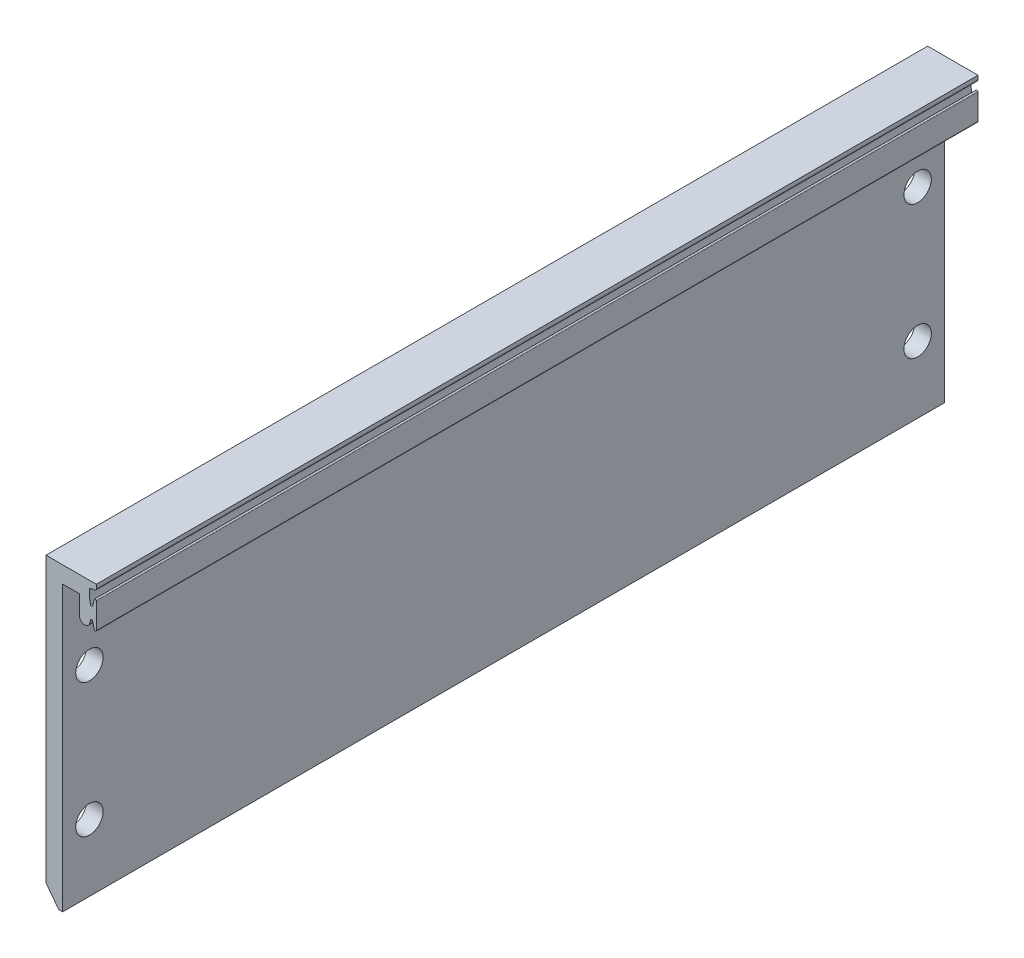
from build123d import *

# Parameters (mm, degrees)
EXTRUDE_1_DEPTH     = 66
SKETCH_2_R          = 2.05
CUT_EXTRUDE_1_DEPTH = 3107.511800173


with BuildPart() as part:
    # Sketch 1 → Extrude 1 (new, symmetric)
    with BuildSketch(Plane.XY):
        with BuildLine():
            Line((2261.939900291, -3061.761167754), (2262.488979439, -3061.672269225))
            ThreePointArc((2262.488979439, -3061.672269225), (2262.669488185, -3061.570568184), (2262.741032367, -3061.376125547))
            Line((2262.741032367, -3061.376125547), (2262.741032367, -3060.801460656))
            Line((2262.741032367, -3060.801460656), (2255.201032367, -3060.801460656))
            Line((2255.201032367, -3060.801460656), (2255.201032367, -3103.301460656))
            Line((2255.201032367, -3103.301460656), (2257.101032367, -3105.801460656))
            Line((2257.101032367, -3105.801460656), (2257.701032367, -3105.801460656))
            Line((2257.701032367, -3105.801460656), (2257.701032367, -3063.301460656))
            Line((2257.701032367, -3063.301460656), (2260.201032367, -3063.301460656))
            Line((2260.201032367, -3063.301460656), (2260.201032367, -3066.167750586))
            ThreePointArc((2260.201032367, -3066.167750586), (2260.881368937, -3066.944613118), (2261.741182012, -3066.372691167))
            Line((2261.741182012, -3066.372691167), (2261.886251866, -3065.83723558))
            ThreePointArc((2261.886251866, -3065.83723558), (2262.032698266, -3065.726469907), (2262.176648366, -3065.84046092))
            Line((2262.176648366, -3065.84046092), (2262.420781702, -3066.82796037))
            ThreePointArc((2262.420781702, -3066.82796037), (2262.598176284, -3066.950268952), (2262.741032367, -3066.788960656))
            Line((2262.741032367, -3066.788960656), (2262.741032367, -3062.963960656))
            ThreePointArc((2262.741032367, -3062.963960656), (2262.598176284, -3062.802652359), (2262.420781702, -3062.924960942))
            Line((2262.420781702, -3062.924960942), (2262.176648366, -3063.912460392))
            ThreePointArc((2262.176648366, -3063.912460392), (2262.021628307, -3064.026165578), (2261.882056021, -3063.893954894))
            ThreePointArc((2261.882056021, -3063.893954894), (2261.718086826, -3062.976641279), (2261.688089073, -3062.045271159))
            ThreePointArc((2261.688089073, -3062.045271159), (2261.763340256, -3061.85832259), (2261.939900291, -3061.761167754))
        make_face()
    extrude(amount=EXTRUDE_1_DEPTH, both=True)

    # Sketch 2 → Cut-Extrude 1 (cut, through all)
    with BuildSketch(Plane.ZY.offset(-2255.201032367)):
        with Locations(Location((-62, -3075.801460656, 0), (0, 0, 270))):
            Circle(SKETCH_2_R)
        with Locations(Location((-62, -3095.801460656, 0), (0, 0, 270))):
            Circle(SKETCH_2_R)
        with Locations(Location((62, -3095.801460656, 0), (0, 0, 270))):
            Circle(SKETCH_2_R)
        with Locations(Location((62, -3075.801460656, 0), (0, 0, 270))):
            Circle(SKETCH_2_R)
    extrude(amount=-CUT_EXTRUDE_1_DEPTH, mode=Mode.SUBTRACT)


solid = part.part
